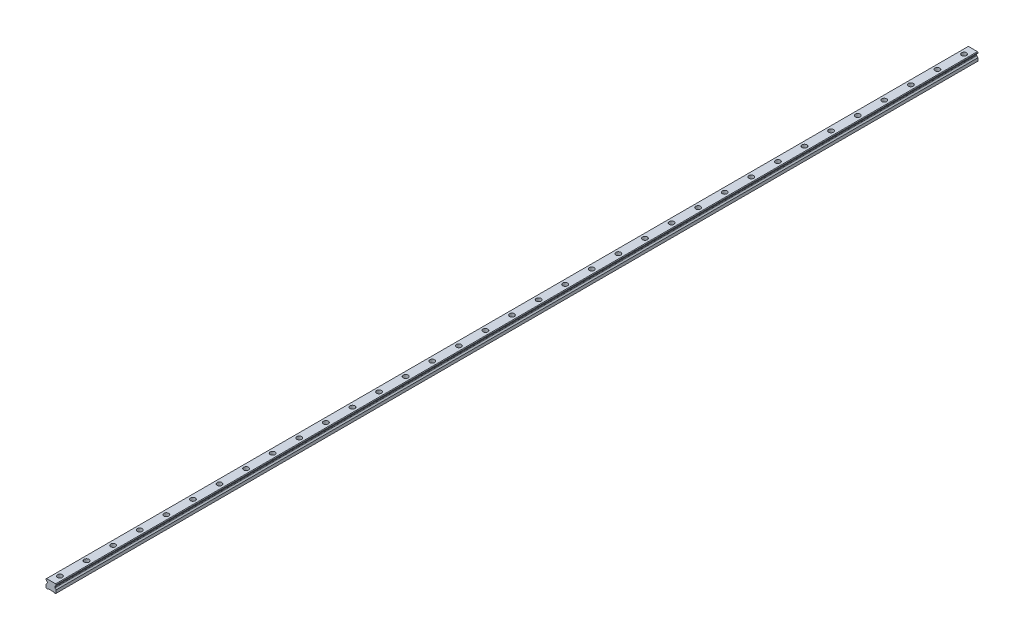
from build123d import *

# Parameters (mm, degrees)
SKETCH1_W           = 23
SKETCH1_H           = 19.2
BOSS_EXTRUDE1_DEPTH = 1040
CUT_EXTRUDE1_DEPTH  = 2081.120402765
CHAMFER1_SIZE       = 1.25
FILLET1_R           = 1.25
CUT_EXTRUDE2_DEPTH  = 2081.120402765
SKETCH4_R           = 5.5
SKETCH4_R_2         = 3.5
CUT_EXTRUDE3_DEPTH  = 9
SKETCH4_2_R         = 3.5
CUT_EXTRUDE4_DEPTH  = 1041.240784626
LPATTERN1_COUNT     = 35
LPATTERN1_PITCH     = 60


with BuildPart() as part:
    # Sketch1 → Boss-Extrude1 (new, symmetric)
    with BuildSketch(Plane.XY):
        with Locations((0, 9.6)):
            Rectangle(SKETCH1_W, SKETCH1_H)
    extrude(amount=BOSS_EXTRUDE1_DEPTH, both=True)

    # Sketch2 → Cut-Extrude1 (cut, through all)
    with BuildSketch(Plane.XY.offset(1040)):
        Polygon((-11.5, 16.7), (-11.5, 7.95), (-8.583333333, 10.866666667), (-8.583333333, 13.783333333), align=None)
        Polygon((8.583333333, 13.783333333), (11.5, 16.7), (11.5, 7.95), (8.583333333, 10.866666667), align=None)
    extrude(amount=-CUT_EXTRUDE1_DEPTH, mode=Mode.SUBTRACT)

    # Chamfer1
    chamfer1_edges = [part.edges().sort_by_distance(p)[0] for p in [
        (-11.5, 19.2, 0),
        (11.5, 19.2, 0),
        (11.5, 0, 0),
        (-11.5, 0, 0),
    ]]
    chamfer(chamfer1_edges, length=CHAMFER1_SIZE)

    # Fillet1
    fillet1_edges = [part.edges().sort_by_distance(p)[0] for p in [
        (-8.583333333, 13.783333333, 0),
        (-8.583333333, 10.866666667, 0),
        (8.583333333, 10.866666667, 0),
        (8.583333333, 13.783333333, 0),
    ]]
    fillet(fillet1_edges, radius=FILLET1_R)

    # Sketch3 → Cut-Extrude2 (cut, through all)
    with BuildSketch(Plane.XY.offset(1040)):
        Polygon((-7, 0), (-5.75, 1.25), (5.75, 1.25), (7, 0), align=None)
    extrude(amount=-CUT_EXTRUDE2_DEPTH, mode=Mode.SUBTRACT)

    # Sketch4 → Cut-Extrude3 (cut)
    with BuildSketch(Plane(origin=(0, 19.2, 0), x_dir=(1, 0, 0), z_dir=(0, 1, 0))):
        with Locations(Location((0, -1020, 0), (0, 0, 270))):
            Circle(SKETCH4_R)
        with Locations(Location((0, -1020, 0), (0, 0, 270))):
            Circle(SKETCH4_R_2, mode=Mode.SUBTRACT)
    cut_extrude3 = extrude(amount=-CUT_EXTRUDE3_DEPTH, mode=Mode.SUBTRACT)

    # Sketch4_2 → Cut-Extrude4 (cut, through all)
    with BuildSketch(Plane(origin=(0, 19.2, 0), x_dir=(1, 0, 0), z_dir=(0, 1, 0))):
        with Locations(Location((0, -1020, 0), (0, 0, 270))):
            Circle(SKETCH4_2_R)
    cut_extrude4 = extrude(amount=-CUT_EXTRUDE4_DEPTH, mode=Mode.SUBTRACT)

    # LPattern1: Cut-Extrude3, Cut-Extrude4 ×35
    with Locations(*[(0, 0, -i * LPATTERN1_PITCH) for i in range(1, LPATTERN1_COUNT)]):
        add(cut_extrude3, mode=Mode.SUBTRACT)
        add(cut_extrude4, mode=Mode.SUBTRACT)


solid = part.part
